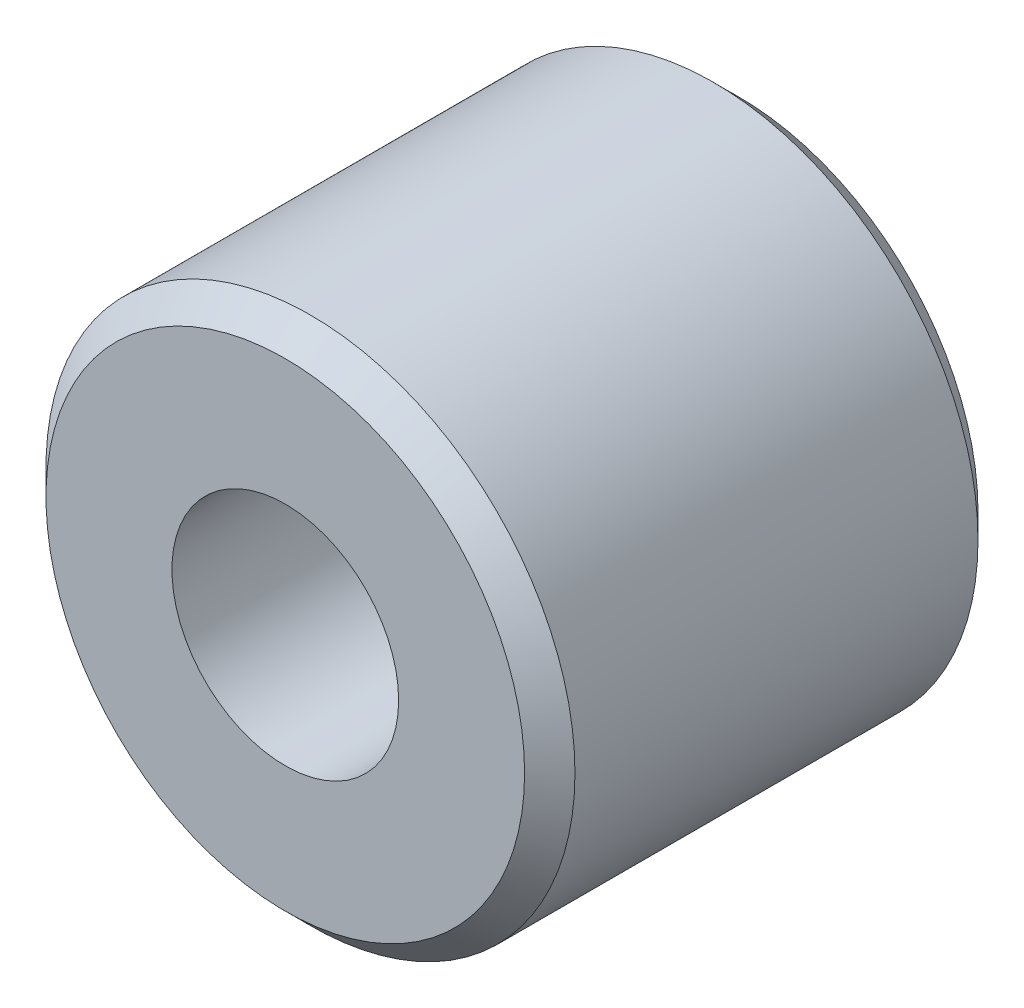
ISO-10303-21;
HEADER;
FILE_DESCRIPTION(('STEP AP214'),'2;1');
FILE_NAME('part.step','',(''),(''),'','','');
FILE_SCHEMA(('AUTOMOTIVE_DESIGN { 1 0 10303 214 1 1 1 1 }'));
ENDSEC;
DATA;
#1=APPLICATION_CONTEXT('core data for automotive mechanical design processes');
#2=APPLICATION_PROTOCOL_DEFINITION('international standard','automotive_design',2000,#1);
#3=PRODUCT_CONTEXT('',#1,'mechanical');
#4=PRODUCT('Part','Part','',(#3));
#5=PRODUCT_RELATED_PRODUCT_CATEGORY('part','',(#4));
#6=PRODUCT_DEFINITION_FORMATION('','',#4);
#7=PRODUCT_DEFINITION_CONTEXT('part definition',#1,'design');
#8=PRODUCT_DEFINITION('design','',#6,#7);
#9=PRODUCT_DEFINITION_SHAPE('','',#8);
#10=(LENGTH_UNIT() NAMED_UNIT(*) SI_UNIT(.MILLI.,.METRE.));
#11=(NAMED_UNIT(*) PLANE_ANGLE_UNIT() SI_UNIT($,.RADIAN.));
#12=(NAMED_UNIT(*) SI_UNIT($,.STERADIAN.) SOLID_ANGLE_UNIT());
#13=UNCERTAINTY_MEASURE_WITH_UNIT(LENGTH_MEASURE(1.E-05),#10,'distance_accuracy_value','');
#14=(GEOMETRIC_REPRESENTATION_CONTEXT(3) GLOBAL_UNCERTAINTY_ASSIGNED_CONTEXT((#13)) GLOBAL_UNIT_ASSIGNED_CONTEXT((#10,
#11,#12)) REPRESENTATION_CONTEXT('',''));
#15=CARTESIAN_POINT('',(0.,0.,0.));
#16=DIRECTION('',(0.,0.,1.));
#17=DIRECTION('',(1.,0.,0.));
#18=AXIS2_PLACEMENT_3D('',#15,#16,#17);
#19=CARTESIAN_POINT('',(0.,0.,36.));
#20=DIRECTION('',(0.,0.,1.));
#21=DIRECTION('',(1.,0.,0.));
#22=AXIS2_PLACEMENT_3D('',#19,#20,#21);
#23=PLANE('',#22);
#24=CARTESIAN_POINT('',(0.,0.,36.));
#25=DIRECTION('',(0.,0.,1.));
#26=DIRECTION('',(1.,0.,0.));
#27=AXIS2_PLACEMENT_3D('',#24,#25,#26);
#28=CIRCLE('',#27,19.);
#29=CARTESIAN_POINT('',(19.,0.,36.));
#30=VERTEX_POINT('',#29);
#31=EDGE_CURVE('E10',#30,#30,#28,.T.);
#32=ORIENTED_EDGE('',*,*,#31,.T.);
#33=EDGE_LOOP('',(#32));
#34=FACE_BOUND('',#33,.T.);
#35=CARTESIAN_POINT('',(0.,0.,36.));
#36=DIRECTION('',(0.,0.,1.));
#37=DIRECTION('',(1.,0.,0.));
#38=AXIS2_PLACEMENT_3D('',#35,#36,#37);
#39=CIRCLE('',#38,9.);
#40=CARTESIAN_POINT('',(9.,0.,36.));
#41=VERTEX_POINT('',#40);
#42=EDGE_CURVE('E44',#41,#41,#39,.T.);
#43=ORIENTED_EDGE('',*,*,#42,.F.);
#44=EDGE_LOOP('',(#43));
#45=FACE_BOUND('',#44,.T.);
#46=ADVANCED_FACE('F24',(#34,#45),#23,.T.);
#47=CARTESIAN_POINT('',(0.,0.,0.));
#48=DIRECTION('',(0.,0.,1.));
#49=DIRECTION('',(1.,0.,0.));
#50=AXIS2_PLACEMENT_3D('',#47,#48,#49);
#51=PLANE('',#50);
#52=CARTESIAN_POINT('',(0.,0.,0.));
#53=DIRECTION('',(0.,0.,1.));
#54=DIRECTION('',(1.,0.,0.));
#55=AXIS2_PLACEMENT_3D('',#52,#53,#54);
#56=CIRCLE('',#55,19.);
#57=CARTESIAN_POINT('',(19.,0.,0.));
#58=VERTEX_POINT('',#57);
#59=EDGE_CURVE('E31',#58,#58,#56,.F.);
#60=ORIENTED_EDGE('',*,*,#59,.T.);
#61=EDGE_LOOP('',(#60));
#62=FACE_BOUND('',#61,.T.);
#63=CARTESIAN_POINT('',(0.,0.,0.));
#64=DIRECTION('',(0.,0.,1.));
#65=DIRECTION('',(1.,0.,0.));
#66=AXIS2_PLACEMENT_3D('',#63,#64,#65);
#67=CIRCLE('',#66,9.);
#68=CARTESIAN_POINT('',(9.,0.,0.));
#69=VERTEX_POINT('',#68);
#70=EDGE_CURVE('E47',#69,#69,#67,.T.);
#71=ORIENTED_EDGE('',*,*,#70,.T.);
#72=EDGE_LOOP('',(#71));
#73=FACE_BOUND('',#72,.T.);
#74=ADVANCED_FACE('F51',(#62,#73),#51,.F.);
#75=CARTESIAN_POINT('',(0.,0.,36.));
#76=DIRECTION('',(0.,0.,-1.));
#77=DIRECTION('',(-1.,0.,0.));
#78=AXIS2_PLACEMENT_3D('',#75,#76,#77);
#79=CYLINDRICAL_SURFACE('',#78,21.);
#80=CARTESIAN_POINT('',(0.,0.,2.));
#81=DIRECTION('',(0.,0.,1.));
#82=DIRECTION('',(1.,0.,0.));
#83=AXIS2_PLACEMENT_3D('',#80,#81,#82);
#84=CIRCLE('',#83,21.);
#85=CARTESIAN_POINT('',(21.,0.,2.));
#86=VERTEX_POINT('',#85);
#87=EDGE_CURVE('E35',#86,#86,#84,.T.);
#88=ORIENTED_EDGE('',*,*,#87,.T.);
#89=EDGE_LOOP('',(#88));
#90=FACE_BOUND('',#89,.T.);
#91=CARTESIAN_POINT('',(0.,0.,34.));
#92=DIRECTION('',(0.,0.,1.));
#93=DIRECTION('',(1.,0.,0.));
#94=AXIS2_PLACEMENT_3D('',#91,#92,#93);
#95=CIRCLE('',#94,21.);
#96=CARTESIAN_POINT('',(21.,0.,34.));
#97=VERTEX_POINT('',#96);
#98=EDGE_CURVE('E39',#97,#97,#95,.F.);
#99=ORIENTED_EDGE('',*,*,#98,.T.);
#100=EDGE_LOOP('',(#99));
#101=FACE_BOUND('',#100,.T.);
#102=ADVANCED_FACE('F26',(#90,#101),#79,.T.);
#103=CARTESIAN_POINT('',(0.,0.,36.));
#104=DIRECTION('',(0.,0.,-1.));
#105=DIRECTION('',(-1.,0.,0.));
#106=AXIS2_PLACEMENT_3D('',#103,#104,#105);
#107=CYLINDRICAL_SURFACE('',#106,9.);
#108=ORIENTED_EDGE('',*,*,#42,.T.);
#109=EDGE_LOOP('',(#108));
#110=FACE_BOUND('',#109,.T.);
#111=ORIENTED_EDGE('',*,*,#70,.F.);
#112=EDGE_LOOP('',(#111));
#113=FACE_BOUND('',#112,.T.);
#114=ADVANCED_FACE('F53',(#110,#113),#107,.F.);
#115=CARTESIAN_POINT('',(0.,0.,2.));
#116=DIRECTION('',(0.,0.,1.));
#117=DIRECTION('',(1.,0.,0.));
#118=AXIS2_PLACEMENT_3D('',#115,#116,#117);
#119=CONICAL_SURFACE('',#118,21.,0.78539816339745);
#120=ORIENTED_EDGE('',*,*,#59,.F.);
#121=EDGE_LOOP('',(#120));
#122=FACE_BOUND('',#121,.T.);
#123=ORIENTED_EDGE('',*,*,#87,.F.);
#124=EDGE_LOOP('',(#123));
#125=FACE_BOUND('',#124,.T.);
#126=ADVANCED_FACE('F55',(#122,#125),#119,.T.);
#127=CARTESIAN_POINT('',(0.,0.,36.));
#128=DIRECTION('',(0.,0.,-1.));
#129=DIRECTION('',(-1.,0.,0.));
#130=AXIS2_PLACEMENT_3D('',#127,#128,#129);
#131=CONICAL_SURFACE('',#130,19.,0.785398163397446);
#132=ORIENTED_EDGE('',*,*,#98,.F.);
#133=EDGE_LOOP('',(#132));
#134=FACE_BOUND('',#133,.T.);
#135=ORIENTED_EDGE('',*,*,#31,.F.);
#136=EDGE_LOOP('',(#135));
#137=FACE_BOUND('',#136,.T.);
#138=ADVANCED_FACE('F62',(#134,#137),#131,.T.);
#139=CLOSED_SHELL('',(#46,#74,#102,#114,#126,#138));
#140=MANIFOLD_SOLID_BREP('B2',#139);
#141=ADVANCED_BREP_SHAPE_REPRESENTATION('',(#18,#140),#14);
#142=SHAPE_DEFINITION_REPRESENTATION(#9,#141);
ENDSEC;
END-ISO-10303-21;
